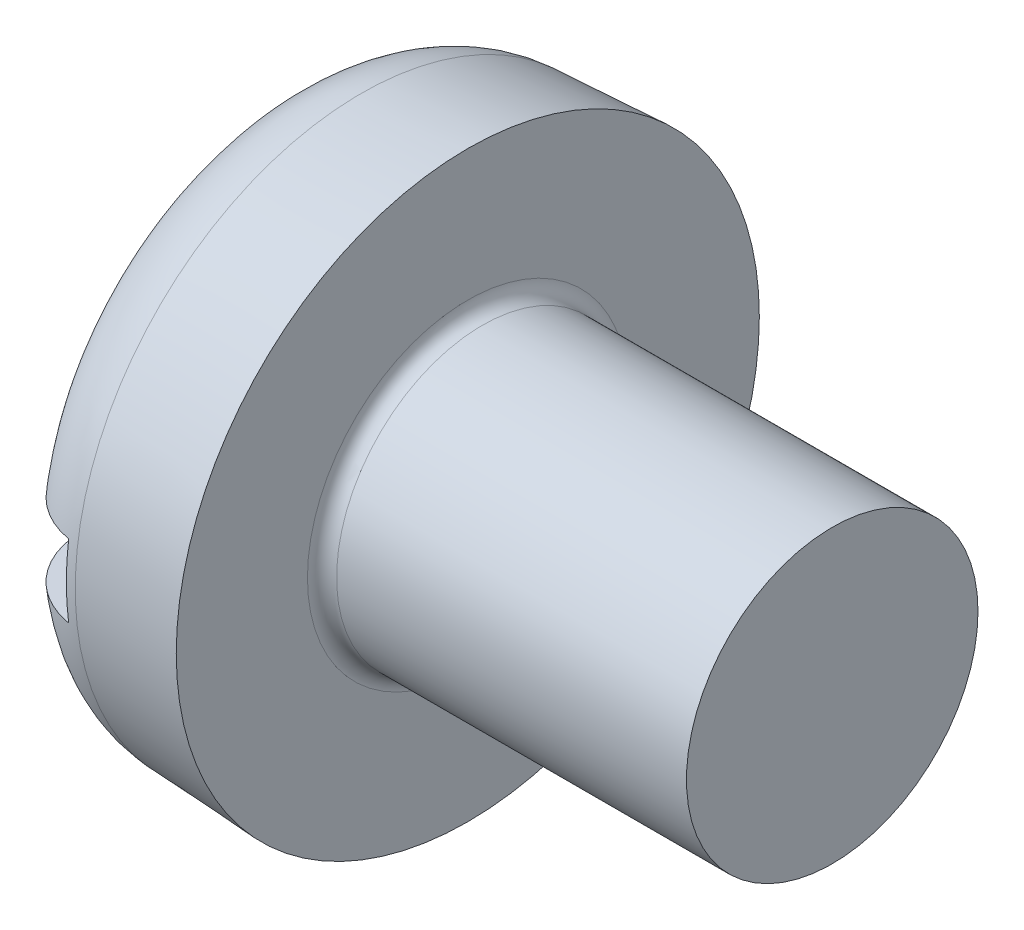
from build123d import *

# Parameters (mm, degrees)
SKETCH1_R        = 2
BASEHEAD_DEPTH   = 1.3
BASEHEAD_DRAFT   = -3
SKETCH2_R        = 1
BASEBODY_DEPTH   = 2.5
HEADFILLET2_R    = 0.6
NOTCH_DEPTH      = 5.567822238
NOTCH_DEPTH_BACK = 5.567822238
SKETCH3_W        = 0.5
SKETCH3_H        = 0.5
HEADFILLET1_R    = 0.1


with BuildPart() as part:
    # Sketch1 → BaseHead (with draft: the straight prism first)
    with BuildSketch(Plane(origin=(1.3, 0, 0), x_dir=(0, 0, -1), z_dir=(1, 0, 0))):
        Circle(SKETCH1_R)
    extrude(amount=-BASEHEAD_DEPTH)
    # BaseHead: the draft: its side faces are tilted about the plane it starts from
    basehead_sides = [part.faces().sort_by_distance(p)[0] for p in [
        (0.65, 0, 2),
    ]]
    draft(basehead_sides, Plane(origin=(1.3, 0, 0), x_dir=(0, 0, -1), z_dir=(1, 0, 0)), BASEHEAD_DRAFT)

    # Sketch2 → BaseBody (add)
    with BuildSketch(Plane(origin=(1.3, 0, 0), x_dir=(0, 0, -1), z_dir=(1, 0, 0))):
        Circle(SKETCH2_R)
    extrude(amount=BASEBODY_DEPTH)

    # HeadFillet2
    headfillet2_edges = [part.edges().sort_by_distance(p)[0] for p in [
        (0, 0, 1.931869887),
    ]]
    fillet(headfillet2_edges, radius=HEADFILLET2_R)

    # Sketch3 → Notch (cut, two sides: drawn at the far end of the back side and taken through both)
    with BuildSketch(Plane(origin=(1.05, -1.05, 0), x_dir=(0, -1, 0), z_dir=(0, 0, 1)).offset(-NOTCH_DEPTH_BACK)):
        with Locations((-1.05, -0.8)):
            Rectangle(SKETCH3_W, SKETCH3_H)
    extrude(amount=NOTCH_DEPTH + NOTCH_DEPTH_BACK, mode=Mode.SUBTRACT)

    # HeadFillet1
    headfillet1_edges = [part.edges().sort_by_distance(p)[0] for p in [
        (1.3, 0, 1),
    ]]
    fillet(headfillet1_edges, radius=HEADFILLET1_R)


solid = part.part
